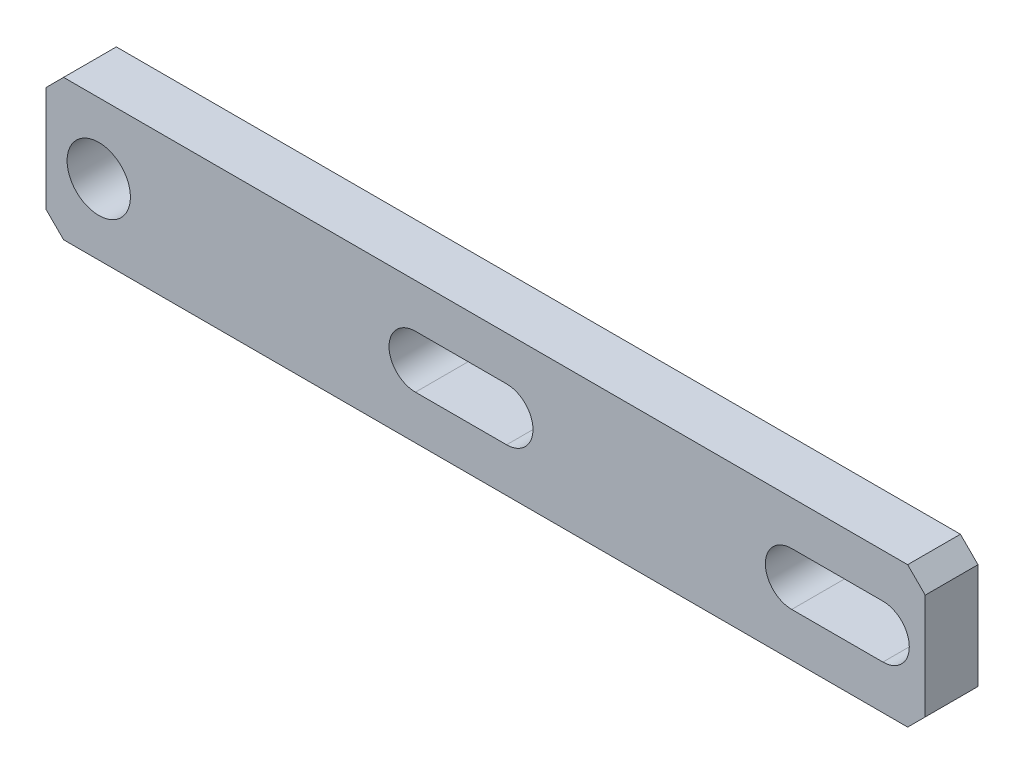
ISO-10303-21;
HEADER;
FILE_DESCRIPTION(('STEP AP214'),'2;1');
FILE_NAME('part.step','',(''),(''),'','','');
FILE_SCHEMA(('AUTOMOTIVE_DESIGN { 1 0 10303 214 1 1 1 1 }'));
ENDSEC;
DATA;
#1=APPLICATION_CONTEXT('core data for automotive mechanical design processes');
#2=APPLICATION_PROTOCOL_DEFINITION('international standard','automotive_design',2000,#1);
#3=PRODUCT_CONTEXT('',#1,'mechanical');
#4=PRODUCT('Part','Part','',(#3));
#5=PRODUCT_RELATED_PRODUCT_CATEGORY('part','',(#4));
#6=PRODUCT_DEFINITION_FORMATION('','',#4);
#7=PRODUCT_DEFINITION_CONTEXT('part definition',#1,'design');
#8=PRODUCT_DEFINITION('design','',#6,#7);
#9=PRODUCT_DEFINITION_SHAPE('','',#8);
#10=(LENGTH_UNIT() NAMED_UNIT(*) SI_UNIT(.MILLI.,.METRE.));
#11=(NAMED_UNIT(*) PLANE_ANGLE_UNIT() SI_UNIT($,.RADIAN.));
#12=(NAMED_UNIT(*) SI_UNIT($,.STERADIAN.) SOLID_ANGLE_UNIT());
#13=UNCERTAINTY_MEASURE_WITH_UNIT(LENGTH_MEASURE(1.E-05),#10,'distance_accuracy_value','');
#14=(GEOMETRIC_REPRESENTATION_CONTEXT(3) GLOBAL_UNCERTAINTY_ASSIGNED_CONTEXT((#13)) GLOBAL_UNIT_ASSIGNED_CONTEXT((#10,
#11,#12)) REPRESENTATION_CONTEXT('',''));
#15=CARTESIAN_POINT('',(0.,0.,0.));
#16=DIRECTION('',(0.,0.,1.));
#17=DIRECTION('',(1.,0.,0.));
#18=AXIS2_PLACEMENT_3D('',#15,#16,#17);
#19=CARTESIAN_POINT('',(265.,20.,15.));
#20=DIRECTION('',(0.,0.,-1.));
#21=DIRECTION('',(-1.,0.,0.));
#22=AXIS2_PLACEMENT_3D('',#19,#20,#21);
#23=PLANE('',#22);
#24=CARTESIAN_POINT('',(15.,20.,15.));
#25=DIRECTION('',(0.,0.,1.));
#26=DIRECTION('',(1.,0.,0.));
#27=AXIS2_PLACEMENT_3D('',#24,#25,#26);
#28=CIRCLE('',#27,9.);
#29=CARTESIAN_POINT('',(24.,20.,15.));
#30=VERTEX_POINT('',#29);
#31=EDGE_CURVE('E380',#30,#30,#28,.T.);
#32=ORIENTED_EDGE('',*,*,#31,.F.);
#33=EDGE_LOOP('',(#32));
#34=FACE_BOUND('',#33,.T.);
#35=DIRECTION('',(-1.,0.,0.));
#36=VECTOR('',#35,1.);
#37=CARTESIAN_POINT('',(130.96,27.5,15.));
#38=LINE('',#37,#36);
#39=CARTESIAN_POINT('',(130.96,27.5,15.));
#40=VERTEX_POINT('',#39);
#41=CARTESIAN_POINT('',(105.04,27.5,15.));
#42=VERTEX_POINT('',#41);
#43=EDGE_CURVE('E176',#40,#42,#38,.T.);
#44=ORIENTED_EDGE('',*,*,#43,.F.);
#45=CARTESIAN_POINT('',(130.96,20.,15.));
#46=DIRECTION('',(0.,0.,1.));
#47=DIRECTION('',(1.,0.,0.));
#48=AXIS2_PLACEMENT_3D('',#45,#46,#47);
#49=CIRCLE('',#48,7.5);
#50=CARTESIAN_POINT('',(130.96,12.5,15.));
#51=VERTEX_POINT('',#50);
#52=EDGE_CURVE('E48',#51,#40,#49,.T.);
#53=ORIENTED_EDGE('',*,*,#52,.F.);
#54=DIRECTION('',(1.,0.,0.));
#55=VECTOR('',#54,1.);
#56=CARTESIAN_POINT('',(130.96,12.5,15.));
#57=LINE('',#56,#55);
#58=CARTESIAN_POINT('',(105.04,12.5,15.));
#59=VERTEX_POINT('',#58);
#60=EDGE_CURVE('E164',#59,#51,#57,.T.);
#61=ORIENTED_EDGE('',*,*,#60,.F.);
#62=CARTESIAN_POINT('',(105.04,20.,15.));
#63=DIRECTION('',(0.,0.,1.));
#64=DIRECTION('',(1.,0.,0.));
#65=AXIS2_PLACEMENT_3D('',#62,#63,#64);
#66=CIRCLE('',#65,7.5);
#67=EDGE_CURVE('E167',#42,#59,#66,.T.);
#68=ORIENTED_EDGE('',*,*,#67,.F.);
#69=EDGE_LOOP('',(#44,#53,#61,#68));
#70=FACE_BOUND('',#69,.T.);
#71=DIRECTION('',(-0.707106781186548,0.707106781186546,0.));
#72=VECTOR('',#71,1.);
#73=CARTESIAN_POINT('',(245.,40.,15.));
#74=LINE('',#73,#72);
#75=CARTESIAN_POINT('',(250.,35.,15.));
#76=VERTEX_POINT('',#75);
#77=CARTESIAN_POINT('',(245.,40.,15.));
#78=VERTEX_POINT('',#77);
#79=EDGE_CURVE('E217',#76,#78,#74,.T.);
#80=ORIENTED_EDGE('',*,*,#79,.T.);
#81=DIRECTION('',(-1.,0.,0.));
#82=VECTOR('',#81,1.);
#83=CARTESIAN_POINT('',(5.,40.,15.));
#84=LINE('',#83,#82);
#85=CARTESIAN_POINT('',(5.,40.,15.));
#86=VERTEX_POINT('',#85);
#87=EDGE_CURVE('E220',#78,#86,#84,.T.);
#88=ORIENTED_EDGE('',*,*,#87,.T.);
#89=DIRECTION('',(-0.707106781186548,-0.707106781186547,0.));
#90=VECTOR('',#89,1.);
#91=CARTESIAN_POINT('',(0.,35.,15.));
#92=LINE('',#91,#90);
#93=CARTESIAN_POINT('',(0.,35.,15.));
#94=VERTEX_POINT('',#93);
#95=EDGE_CURVE('E223',#86,#94,#92,.T.);
#96=ORIENTED_EDGE('',*,*,#95,.T.);
#97=DIRECTION('',(0.,-1.,0.));
#98=VECTOR('',#97,1.);
#99=CARTESIAN_POINT('',(0.,5.,15.));
#100=LINE('',#99,#98);
#101=CARTESIAN_POINT('',(0.,5.,15.));
#102=VERTEX_POINT('',#101);
#103=EDGE_CURVE('E225',#94,#102,#100,.T.);
#104=ORIENTED_EDGE('',*,*,#103,.T.);
#105=DIRECTION('',(0.707106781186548,-0.707106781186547,0.));
#106=VECTOR('',#105,1.);
#107=CARTESIAN_POINT('',(5.,0.,15.));
#108=LINE('',#107,#106);
#109=CARTESIAN_POINT('',(5.,0.,15.));
#110=VERTEX_POINT('',#109);
#111=EDGE_CURVE('E227',#102,#110,#108,.T.);
#112=ORIENTED_EDGE('',*,*,#111,.T.);
#113=DIRECTION('',(1.,0.,0.));
#114=VECTOR('',#113,1.);
#115=CARTESIAN_POINT('',(245.,0.,15.));
#116=LINE('',#115,#114);
#117=CARTESIAN_POINT('',(245.,0.,15.));
#118=VERTEX_POINT('',#117);
#119=EDGE_CURVE('E229',#110,#118,#116,.T.);
#120=ORIENTED_EDGE('',*,*,#119,.T.);
#121=DIRECTION('',(0.707106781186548,0.707106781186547,0.));
#122=VECTOR('',#121,1.);
#123=CARTESIAN_POINT('',(250.,5.,15.));
#124=LINE('',#123,#122);
#125=CARTESIAN_POINT('',(250.,5.,15.));
#126=VERTEX_POINT('',#125);
#127=EDGE_CURVE('E231',#118,#126,#124,.T.);
#128=ORIENTED_EDGE('',*,*,#127,.T.);
#129=DIRECTION('',(0.,1.,0.));
#130=VECTOR('',#129,1.);
#131=CARTESIAN_POINT('',(250.,35.,15.));
#132=LINE('',#131,#130);
#133=EDGE_CURVE('E233',#126,#76,#132,.T.);
#134=ORIENTED_EDGE('',*,*,#133,.T.);
#135=EDGE_LOOP('',(#80,#88,#96,#104,#112,#120,#128,#134));
#136=FACE_BOUND('',#135,.T.);
#137=CARTESIAN_POINT('',(237.960845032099,20.,15.));
#138=DIRECTION('',(0.,0.,1.));
#139=DIRECTION('',(1.,0.,0.));
#140=AXIS2_PLACEMENT_3D('',#137,#138,#139);
#141=CIRCLE('',#140,7.5);
#142=CARTESIAN_POINT('',(237.960845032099,12.5,15.));
#143=VERTEX_POINT('',#142);
#144=CARTESIAN_POINT('',(237.960845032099,27.5,15.));
#145=VERTEX_POINT('',#144);
#146=EDGE_CURVE('E186',#143,#145,#141,.T.);
#147=ORIENTED_EDGE('',*,*,#146,.F.);
#148=DIRECTION('',(1.,0.,0.));
#149=VECTOR('',#148,1.);
#150=CARTESIAN_POINT('',(237.960845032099,12.5,15.));
#151=LINE('',#150,#149);
#152=CARTESIAN_POINT('',(212.039154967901,12.5,15.));
#153=VERTEX_POINT('',#152);
#154=EDGE_CURVE('E194',#153,#143,#151,.T.);
#155=ORIENTED_EDGE('',*,*,#154,.F.);
#156=CARTESIAN_POINT('',(212.039154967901,20.,15.));
#157=DIRECTION('',(0.,0.,1.));
#158=DIRECTION('',(1.,0.,0.));
#159=AXIS2_PLACEMENT_3D('',#156,#157,#158);
#160=CIRCLE('',#159,7.5);
#161=CARTESIAN_POINT('',(212.039154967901,27.5,15.));
#162=VERTEX_POINT('',#161);
#163=EDGE_CURVE('E191',#162,#153,#160,.T.);
#164=ORIENTED_EDGE('',*,*,#163,.F.);
#165=DIRECTION('',(-1.,0.,0.));
#166=VECTOR('',#165,1.);
#167=CARTESIAN_POINT('',(237.960845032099,27.5,15.));
#168=LINE('',#167,#166);
#169=EDGE_CURVE('E188',#145,#162,#168,.T.);
#170=ORIENTED_EDGE('',*,*,#169,.F.);
#171=EDGE_LOOP('',(#147,#155,#164,#170));
#172=FACE_BOUND('',#171,.T.);
#173=ADVANCED_FACE('F33',(#34,#70,#136,#172),#23,.F.);
#174=CARTESIAN_POINT('',(265.,20.,0.));
#175=DIRECTION('',(0.,0.,-1.));
#176=DIRECTION('',(-1.,0.,0.));
#177=AXIS2_PLACEMENT_3D('',#174,#175,#176);
#178=PLANE('',#177);
#179=CARTESIAN_POINT('',(15.,20.,0.));
#180=DIRECTION('',(0.,0.,1.));
#181=DIRECTION('',(1.,0.,0.));
#182=AXIS2_PLACEMENT_3D('',#179,#180,#181);
#183=CIRCLE('',#182,9.);
#184=CARTESIAN_POINT('',(24.,20.,0.));
#185=VERTEX_POINT('',#184);
#186=EDGE_CURVE('E170',#185,#185,#183,.T.);
#187=ORIENTED_EDGE('',*,*,#186,.T.);
#188=EDGE_LOOP('',(#187));
#189=FACE_BOUND('',#188,.T.);
#190=CARTESIAN_POINT('',(130.96,20.,0.));
#191=DIRECTION('',(0.,0.,1.));
#192=DIRECTION('',(1.,0.,0.));
#193=AXIS2_PLACEMENT_3D('',#190,#191,#192);
#194=CIRCLE('',#193,7.5);
#195=CARTESIAN_POINT('',(130.96,12.5,0.));
#196=VERTEX_POINT('',#195);
#197=CARTESIAN_POINT('',(130.96,27.5,0.));
#198=VERTEX_POINT('',#197);
#199=EDGE_CURVE('E148',#196,#198,#194,.T.);
#200=ORIENTED_EDGE('',*,*,#199,.T.);
#201=DIRECTION('',(-1.,0.,0.));
#202=VECTOR('',#201,1.);
#203=CARTESIAN_POINT('',(130.96,27.5,0.));
#204=LINE('',#203,#202);
#205=CARTESIAN_POINT('',(105.04,27.5,0.));
#206=VERTEX_POINT('',#205);
#207=EDGE_CURVE('E157',#198,#206,#204,.T.);
#208=ORIENTED_EDGE('',*,*,#207,.T.);
#209=CARTESIAN_POINT('',(105.04,20.,0.));
#210=DIRECTION('',(0.,0.,1.));
#211=DIRECTION('',(1.,0.,0.));
#212=AXIS2_PLACEMENT_3D('',#209,#210,#211);
#213=CIRCLE('',#212,7.5);
#214=CARTESIAN_POINT('',(105.04,12.5,0.));
#215=VERTEX_POINT('',#214);
#216=EDGE_CURVE('E56',#206,#215,#213,.T.);
#217=ORIENTED_EDGE('',*,*,#216,.T.);
#218=DIRECTION('',(1.,0.,0.));
#219=VECTOR('',#218,1.);
#220=CARTESIAN_POINT('',(130.96,12.5,0.));
#221=LINE('',#220,#219);
#222=EDGE_CURVE('E154',#215,#196,#221,.T.);
#223=ORIENTED_EDGE('',*,*,#222,.T.);
#224=EDGE_LOOP('',(#200,#208,#217,#223));
#225=FACE_BOUND('',#224,.T.);
#226=DIRECTION('',(-0.707106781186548,0.707106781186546,0.));
#227=VECTOR('',#226,1.);
#228=CARTESIAN_POINT('',(245.,40.,0.));
#229=LINE('',#228,#227);
#230=CARTESIAN_POINT('',(250.,35.,0.));
#231=VERTEX_POINT('',#230);
#232=CARTESIAN_POINT('',(245.,40.,0.));
#233=VERTEX_POINT('',#232);
#234=EDGE_CURVE('E216',#231,#233,#229,.T.);
#235=ORIENTED_EDGE('',*,*,#234,.F.);
#236=DIRECTION('',(0.,1.,0.));
#237=VECTOR('',#236,1.);
#238=CARTESIAN_POINT('',(250.,35.,0.));
#239=LINE('',#238,#237);
#240=CARTESIAN_POINT('',(250.,5.,0.));
#241=VERTEX_POINT('',#240);
#242=EDGE_CURVE('E221',#241,#231,#239,.T.);
#243=ORIENTED_EDGE('',*,*,#242,.F.);
#244=DIRECTION('',(0.707106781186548,0.707106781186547,0.));
#245=VECTOR('',#244,1.);
#246=CARTESIAN_POINT('',(250.,5.,0.));
#247=LINE('',#246,#245);
#248=CARTESIAN_POINT('',(245.,0.,0.));
#249=VERTEX_POINT('',#248);
#250=EDGE_CURVE('E248',#249,#241,#247,.T.);
#251=ORIENTED_EDGE('',*,*,#250,.F.);
#252=DIRECTION('',(1.,0.,0.));
#253=VECTOR('',#252,1.);
#254=CARTESIAN_POINT('',(245.,0.,0.));
#255=LINE('',#254,#253);
#256=CARTESIAN_POINT('',(5.,0.,0.));
#257=VERTEX_POINT('',#256);
#258=EDGE_CURVE('E246',#257,#249,#255,.T.);
#259=ORIENTED_EDGE('',*,*,#258,.F.);
#260=DIRECTION('',(0.707106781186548,-0.707106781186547,0.));
#261=VECTOR('',#260,1.);
#262=CARTESIAN_POINT('',(5.,0.,0.));
#263=LINE('',#262,#261);
#264=CARTESIAN_POINT('',(0.,5.,0.));
#265=VERTEX_POINT('',#264);
#266=EDGE_CURVE('E244',#265,#257,#263,.T.);
#267=ORIENTED_EDGE('',*,*,#266,.F.);
#268=DIRECTION('',(0.,-1.,0.));
#269=VECTOR('',#268,1.);
#270=CARTESIAN_POINT('',(0.,5.,0.));
#271=LINE('',#270,#269);
#272=CARTESIAN_POINT('',(0.,35.,0.));
#273=VERTEX_POINT('',#272);
#274=EDGE_CURVE('E242',#273,#265,#271,.T.);
#275=ORIENTED_EDGE('',*,*,#274,.F.);
#276=DIRECTION('',(-0.707106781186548,-0.707106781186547,0.));
#277=VECTOR('',#276,1.);
#278=CARTESIAN_POINT('',(0.,35.,0.));
#279=LINE('',#278,#277);
#280=CARTESIAN_POINT('',(5.,40.,0.));
#281=VERTEX_POINT('',#280);
#282=EDGE_CURVE('E240',#281,#273,#279,.T.);
#283=ORIENTED_EDGE('',*,*,#282,.F.);
#284=DIRECTION('',(-1.,0.,0.));
#285=VECTOR('',#284,1.);
#286=CARTESIAN_POINT('',(5.,40.,0.));
#287=LINE('',#286,#285);
#288=EDGE_CURVE('E238',#233,#281,#287,.T.);
#289=ORIENTED_EDGE('',*,*,#288,.F.);
#290=EDGE_LOOP('',(#235,#243,#251,#259,#267,#275,#283,#289));
#291=FACE_BOUND('',#290,.T.);
#292=DIRECTION('',(1.,0.,0.));
#293=VECTOR('',#292,1.);
#294=CARTESIAN_POINT('',(237.960845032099,12.5,0.));
#295=LINE('',#294,#293);
#296=CARTESIAN_POINT('',(212.039154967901,12.5,0.));
#297=VERTEX_POINT('',#296);
#298=CARTESIAN_POINT('',(237.960845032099,12.5,0.));
#299=VERTEX_POINT('',#298);
#300=EDGE_CURVE('E189',#297,#299,#295,.T.);
#301=ORIENTED_EDGE('',*,*,#300,.T.);
#302=CARTESIAN_POINT('',(237.960845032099,20.,0.));
#303=DIRECTION('',(0.,0.,1.));
#304=DIRECTION('',(1.,0.,0.));
#305=AXIS2_PLACEMENT_3D('',#302,#303,#304);
#306=CIRCLE('',#305,7.5);
#307=CARTESIAN_POINT('',(237.960845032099,27.5,0.));
#308=VERTEX_POINT('',#307);
#309=EDGE_CURVE('E182',#299,#308,#306,.T.);
#310=ORIENTED_EDGE('',*,*,#309,.T.);
#311=DIRECTION('',(-1.,0.,0.));
#312=VECTOR('',#311,1.);
#313=CARTESIAN_POINT('',(237.960845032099,27.5,0.));
#314=LINE('',#313,#312);
#315=CARTESIAN_POINT('',(212.039154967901,27.5,0.));
#316=VERTEX_POINT('',#315);
#317=EDGE_CURVE('E199',#308,#316,#314,.T.);
#318=ORIENTED_EDGE('',*,*,#317,.T.);
#319=CARTESIAN_POINT('',(212.039154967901,20.,0.));
#320=DIRECTION('',(0.,0.,1.));
#321=DIRECTION('',(1.,0.,0.));
#322=AXIS2_PLACEMENT_3D('',#319,#320,#321);
#323=CIRCLE('',#322,7.5);
#324=EDGE_CURVE('E202',#316,#297,#323,.T.);
#325=ORIENTED_EDGE('',*,*,#324,.T.);
#326=EDGE_LOOP('',(#301,#310,#318,#325));
#327=FACE_BOUND('',#326,.T.);
#328=ADVANCED_FACE('F161',(#189,#225,#291,#327),#178,.T.);
#329=CARTESIAN_POINT('',(245.,40.,15.));
#330=DIRECTION('',(-0.707106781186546,-0.707106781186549,0.));
#331=DIRECTION('',(0.707106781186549,-0.707106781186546,0.));
#332=AXIS2_PLACEMENT_3D('',#329,#330,#331);
#333=PLANE('',#332);
#334=ORIENTED_EDGE('',*,*,#234,.T.);
#335=DIRECTION('',(0.,0.,-1.));
#336=VECTOR('',#335,1.);
#337=CARTESIAN_POINT('',(245.,40.,15.));
#338=LINE('',#337,#336);
#339=EDGE_CURVE('E11',#78,#233,#338,.T.);
#340=ORIENTED_EDGE('',*,*,#339,.F.);
#341=ORIENTED_EDGE('',*,*,#79,.F.);
#342=DIRECTION('',(0.,0.,-1.));
#343=VECTOR('',#342,1.);
#344=CARTESIAN_POINT('',(250.,35.,15.));
#345=LINE('',#344,#343);
#346=EDGE_CURVE('E235',#76,#231,#345,.T.);
#347=ORIENTED_EDGE('',*,*,#346,.T.);
#348=EDGE_LOOP('',(#334,#340,#341,#347));
#349=FACE_BOUND('',#348,.T.);
#350=ADVANCED_FACE('F35',(#349),#333,.F.);
#351=CARTESIAN_POINT('',(5.,40.,15.));
#352=DIRECTION('',(0.,-1.,0.));
#353=DIRECTION('',(1.,0.,0.));
#354=AXIS2_PLACEMENT_3D('',#351,#352,#353);
#355=PLANE('',#354);
#356=ORIENTED_EDGE('',*,*,#288,.T.);
#357=DIRECTION('',(0.,0.,-1.));
#358=VECTOR('',#357,1.);
#359=CARTESIAN_POINT('',(5.,40.,15.));
#360=LINE('',#359,#358);
#361=EDGE_CURVE('E41',#86,#281,#360,.T.);
#362=ORIENTED_EDGE('',*,*,#361,.F.);
#363=ORIENTED_EDGE('',*,*,#87,.F.);
#364=ORIENTED_EDGE('',*,*,#339,.T.);
#365=EDGE_LOOP('',(#356,#362,#363,#364));
#366=FACE_BOUND('',#365,.T.);
#367=ADVANCED_FACE('F294',(#366),#355,.F.);
#368=CARTESIAN_POINT('',(0.,35.,15.));
#369=DIRECTION('',(0.707106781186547,-0.707106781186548,0.));
#370=DIRECTION('',(0.707106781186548,0.707106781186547,0.));
#371=AXIS2_PLACEMENT_3D('',#368,#369,#370);
#372=PLANE('',#371);
#373=ORIENTED_EDGE('',*,*,#282,.T.);
#374=DIRECTION('',(0.,0.,-1.));
#375=VECTOR('',#374,1.);
#376=CARTESIAN_POINT('',(0.,35.,15.));
#377=LINE('',#376,#375);
#378=EDGE_CURVE('E265',#94,#273,#377,.T.);
#379=ORIENTED_EDGE('',*,*,#378,.F.);
#380=ORIENTED_EDGE('',*,*,#95,.F.);
#381=ORIENTED_EDGE('',*,*,#361,.T.);
#382=EDGE_LOOP('',(#373,#379,#380,#381));
#383=FACE_BOUND('',#382,.T.);
#384=ADVANCED_FACE('F272',(#383),#372,.F.);
#385=CARTESIAN_POINT('',(0.,5.,15.));
#386=DIRECTION('',(1.,0.,0.));
#387=DIRECTION('',(0.,0.,-1.));
#388=AXIS2_PLACEMENT_3D('',#385,#386,#387);
#389=PLANE('',#388);
#390=ORIENTED_EDGE('',*,*,#274,.T.);
#391=DIRECTION('',(0.,0.,-1.));
#392=VECTOR('',#391,1.);
#393=CARTESIAN_POINT('',(0.,5.,15.));
#394=LINE('',#393,#392);
#395=EDGE_CURVE('E262',#102,#265,#394,.T.);
#396=ORIENTED_EDGE('',*,*,#395,.F.);
#397=ORIENTED_EDGE('',*,*,#103,.F.);
#398=ORIENTED_EDGE('',*,*,#378,.T.);
#399=EDGE_LOOP('',(#390,#396,#397,#398));
#400=FACE_BOUND('',#399,.T.);
#401=ADVANCED_FACE('F282',(#400),#389,.F.);
#402=CARTESIAN_POINT('',(5.,0.,15.));
#403=DIRECTION('',(0.707106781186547,0.707106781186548,0.));
#404=DIRECTION('',(-0.707106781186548,0.707106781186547,0.));
#405=AXIS2_PLACEMENT_3D('',#402,#403,#404);
#406=PLANE('',#405);
#407=ORIENTED_EDGE('',*,*,#266,.T.);
#408=DIRECTION('',(0.,0.,-1.));
#409=VECTOR('',#408,1.);
#410=CARTESIAN_POINT('',(5.,0.,15.));
#411=LINE('',#410,#409);
#412=EDGE_CURVE('E259',#110,#257,#411,.T.);
#413=ORIENTED_EDGE('',*,*,#412,.F.);
#414=ORIENTED_EDGE('',*,*,#111,.F.);
#415=ORIENTED_EDGE('',*,*,#395,.T.);
#416=EDGE_LOOP('',(#407,#413,#414,#415));
#417=FACE_BOUND('',#416,.T.);
#418=ADVANCED_FACE('F286',(#417),#406,.F.);
#419=CARTESIAN_POINT('',(245.,0.,15.));
#420=DIRECTION('',(0.,1.,0.));
#421=DIRECTION('',(-1.,0.,0.));
#422=AXIS2_PLACEMENT_3D('',#419,#420,#421);
#423=PLANE('',#422);
#424=ORIENTED_EDGE('',*,*,#258,.T.);
#425=DIRECTION('',(0.,0.,-1.));
#426=VECTOR('',#425,1.);
#427=CARTESIAN_POINT('',(245.,0.,15.));
#428=LINE('',#427,#426);
#429=EDGE_CURVE('E256',#118,#249,#428,.T.);
#430=ORIENTED_EDGE('',*,*,#429,.F.);
#431=ORIENTED_EDGE('',*,*,#119,.F.);
#432=ORIENTED_EDGE('',*,*,#412,.T.);
#433=EDGE_LOOP('',(#424,#430,#431,#432));
#434=FACE_BOUND('',#433,.T.);
#435=ADVANCED_FACE('F307',(#434),#423,.F.);
#436=CARTESIAN_POINT('',(250.,5.,15.));
#437=DIRECTION('',(-0.707106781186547,0.707106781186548,0.));
#438=DIRECTION('',(-0.707106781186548,-0.707106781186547,0.));
#439=AXIS2_PLACEMENT_3D('',#436,#437,#438);
#440=PLANE('',#439);
#441=ORIENTED_EDGE('',*,*,#250,.T.);
#442=DIRECTION('',(0.,0.,-1.));
#443=VECTOR('',#442,1.);
#444=CARTESIAN_POINT('',(250.,5.,15.));
#445=LINE('',#444,#443);
#446=EDGE_CURVE('E253',#126,#241,#445,.T.);
#447=ORIENTED_EDGE('',*,*,#446,.F.);
#448=ORIENTED_EDGE('',*,*,#127,.F.);
#449=ORIENTED_EDGE('',*,*,#429,.T.);
#450=EDGE_LOOP('',(#441,#447,#448,#449));
#451=FACE_BOUND('',#450,.T.);
#452=ADVANCED_FACE('F305',(#451),#440,.F.);
#453=CARTESIAN_POINT('',(250.,35.,15.));
#454=DIRECTION('',(-1.,0.,0.));
#455=DIRECTION('',(0.,0.,1.));
#456=AXIS2_PLACEMENT_3D('',#453,#454,#455);
#457=PLANE('',#456);
#458=ORIENTED_EDGE('',*,*,#242,.T.);
#459=ORIENTED_EDGE('',*,*,#346,.F.);
#460=ORIENTED_EDGE('',*,*,#133,.F.);
#461=ORIENTED_EDGE('',*,*,#446,.T.);
#462=EDGE_LOOP('',(#458,#459,#460,#461));
#463=FACE_BOUND('',#462,.T.);
#464=ADVANCED_FACE('F300',(#463),#457,.F.);
#465=CARTESIAN_POINT('',(237.960845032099,20.,15.));
#466=DIRECTION('',(0.,0.,-1.));
#467=DIRECTION('',(-1.,0.,0.));
#468=AXIS2_PLACEMENT_3D('',#465,#466,#467);
#469=CYLINDRICAL_SURFACE('',#468,7.5);
#470=ORIENTED_EDGE('',*,*,#309,.F.);
#471=DIRECTION('',(0.,0.,-1.));
#472=VECTOR('',#471,1.);
#473=CARTESIAN_POINT('',(237.960845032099,12.5,15.));
#474=LINE('',#473,#472);
#475=EDGE_CURVE('E196',#143,#299,#474,.T.);
#476=ORIENTED_EDGE('',*,*,#475,.F.);
#477=ORIENTED_EDGE('',*,*,#146,.T.);
#478=DIRECTION('',(0.,0.,-1.));
#479=VECTOR('',#478,1.);
#480=CARTESIAN_POINT('',(237.960845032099,27.5,15.));
#481=LINE('',#480,#479);
#482=EDGE_CURVE('E213',#145,#308,#481,.T.);
#483=ORIENTED_EDGE('',*,*,#482,.T.);
#484=EDGE_LOOP('',(#470,#476,#477,#483));
#485=FACE_BOUND('',#484,.T.);
#486=ADVANCED_FACE('F327',(#485),#469,.F.);
#487=CARTESIAN_POINT('',(237.960845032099,27.5,15.));
#488=DIRECTION('',(0.,-1.,0.));
#489=DIRECTION('',(1.,0.,0.));
#490=AXIS2_PLACEMENT_3D('',#487,#488,#489);
#491=PLANE('',#490);
#492=ORIENTED_EDGE('',*,*,#317,.F.);
#493=ORIENTED_EDGE('',*,*,#482,.F.);
#494=ORIENTED_EDGE('',*,*,#169,.T.);
#495=DIRECTION('',(0.,0.,-1.));
#496=VECTOR('',#495,1.);
#497=CARTESIAN_POINT('',(212.039154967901,27.5,15.));
#498=LINE('',#497,#496);
#499=EDGE_CURVE('E211',#162,#316,#498,.T.);
#500=ORIENTED_EDGE('',*,*,#499,.T.);
#501=EDGE_LOOP('',(#492,#493,#494,#500));
#502=FACE_BOUND('',#501,.T.);
#503=ADVANCED_FACE('F334',(#502),#491,.T.);
#504=CARTESIAN_POINT('',(212.039154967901,20.,15.));
#505=DIRECTION('',(0.,0.,-1.));
#506=DIRECTION('',(-1.,0.,0.));
#507=AXIS2_PLACEMENT_3D('',#504,#505,#506);
#508=CYLINDRICAL_SURFACE('',#507,7.5);
#509=ORIENTED_EDGE('',*,*,#324,.F.);
#510=ORIENTED_EDGE('',*,*,#499,.F.);
#511=ORIENTED_EDGE('',*,*,#163,.T.);
#512=DIRECTION('',(0.,0.,-1.));
#513=VECTOR('',#512,1.);
#514=CARTESIAN_POINT('',(212.039154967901,12.5,15.));
#515=LINE('',#514,#513);
#516=EDGE_CURVE('E209',#153,#297,#515,.T.);
#517=ORIENTED_EDGE('',*,*,#516,.T.);
#518=EDGE_LOOP('',(#509,#510,#511,#517));
#519=FACE_BOUND('',#518,.T.);
#520=ADVANCED_FACE('F339',(#519),#508,.F.);
#521=CARTESIAN_POINT('',(237.960845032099,12.5,15.));
#522=DIRECTION('',(0.,1.,0.));
#523=DIRECTION('',(-1.,0.,0.));
#524=AXIS2_PLACEMENT_3D('',#521,#522,#523);
#525=PLANE('',#524);
#526=ORIENTED_EDGE('',*,*,#300,.F.);
#527=ORIENTED_EDGE('',*,*,#516,.F.);
#528=ORIENTED_EDGE('',*,*,#154,.T.);
#529=ORIENTED_EDGE('',*,*,#475,.T.);
#530=EDGE_LOOP('',(#526,#527,#528,#529));
#531=FACE_BOUND('',#530,.T.);
#532=ADVANCED_FACE('F346',(#531),#525,.T.);
#533=CARTESIAN_POINT('',(130.96,20.,0.));
#534=DIRECTION('',(0.,0.,1.));
#535=DIRECTION('',(1.,0.,0.));
#536=AXIS2_PLACEMENT_3D('',#533,#534,#535);
#537=CYLINDRICAL_SURFACE('',#536,7.5);
#538=ORIENTED_EDGE('',*,*,#52,.T.);
#539=DIRECTION('',(0.,0.,1.));
#540=VECTOR('',#539,1.);
#541=CARTESIAN_POINT('',(130.96,27.5,0.));
#542=LINE('',#541,#540);
#543=EDGE_CURVE('E144',#198,#40,#542,.T.);
#544=ORIENTED_EDGE('',*,*,#543,.F.);
#545=ORIENTED_EDGE('',*,*,#199,.F.);
#546=DIRECTION('',(0.,0.,1.));
#547=VECTOR('',#546,1.);
#548=CARTESIAN_POINT('',(130.96,12.5,0.));
#549=LINE('',#548,#547);
#550=EDGE_CURVE('E180',#196,#51,#549,.T.);
#551=ORIENTED_EDGE('',*,*,#550,.T.);
#552=EDGE_LOOP('',(#538,#544,#545,#551));
#553=FACE_BOUND('',#552,.T.);
#554=ADVANCED_FACE('F146',(#553),#537,.F.);
#555=CARTESIAN_POINT('',(130.96,12.5,0.));
#556=DIRECTION('',(0.,-1.,0.));
#557=DIRECTION('',(1.,0.,0.));
#558=AXIS2_PLACEMENT_3D('',#555,#556,#557);
#559=PLANE('',#558);
#560=ORIENTED_EDGE('',*,*,#60,.T.);
#561=ORIENTED_EDGE('',*,*,#550,.F.);
#562=ORIENTED_EDGE('',*,*,#222,.F.);
#563=DIRECTION('',(0.,0.,1.));
#564=VECTOR('',#563,1.);
#565=CARTESIAN_POINT('',(105.04,12.5,0.));
#566=LINE('',#565,#564);
#567=EDGE_CURVE('E183',#215,#59,#566,.T.);
#568=ORIENTED_EDGE('',*,*,#567,.T.);
#569=EDGE_LOOP('',(#560,#561,#562,#568));
#570=FACE_BOUND('',#569,.T.);
#571=ADVANCED_FACE('F362',(#570),#559,.F.);
#572=CARTESIAN_POINT('',(105.04,20.,0.));
#573=DIRECTION('',(0.,0.,1.));
#574=DIRECTION('',(1.,0.,0.));
#575=AXIS2_PLACEMENT_3D('',#572,#573,#574);
#576=CYLINDRICAL_SURFACE('',#575,7.5);
#577=ORIENTED_EDGE('',*,*,#67,.T.);
#578=ORIENTED_EDGE('',*,*,#567,.F.);
#579=ORIENTED_EDGE('',*,*,#216,.F.);
#580=DIRECTION('',(0.,0.,1.));
#581=VECTOR('',#580,1.);
#582=CARTESIAN_POINT('',(105.04,27.5,0.));
#583=LINE('',#582,#581);
#584=EDGE_CURVE('E153',#206,#42,#583,.T.);
#585=ORIENTED_EDGE('',*,*,#584,.T.);
#586=EDGE_LOOP('',(#577,#578,#579,#585));
#587=FACE_BOUND('',#586,.T.);
#588=ADVANCED_FACE('F366',(#587),#576,.F.);
#589=CARTESIAN_POINT('',(130.96,27.5,0.));
#590=DIRECTION('',(0.,1.,0.));
#591=DIRECTION('',(-1.,0.,0.));
#592=AXIS2_PLACEMENT_3D('',#589,#590,#591);
#593=PLANE('',#592);
#594=ORIENTED_EDGE('',*,*,#43,.T.);
#595=ORIENTED_EDGE('',*,*,#584,.F.);
#596=ORIENTED_EDGE('',*,*,#207,.F.);
#597=ORIENTED_EDGE('',*,*,#543,.T.);
#598=EDGE_LOOP('',(#594,#595,#596,#597));
#599=FACE_BOUND('',#598,.T.);
#600=ADVANCED_FACE('F158',(#599),#593,.F.);
#601=CARTESIAN_POINT('',(15.,20.,15.));
#602=DIRECTION('',(0.,0.,1.));
#603=DIRECTION('',(1.,0.,0.));
#604=AXIS2_PLACEMENT_3D('',#601,#602,#603);
#605=CYLINDRICAL_SURFACE('',#604,9.);
#606=ORIENTED_EDGE('',*,*,#186,.F.);
#607=EDGE_LOOP('',(#606));
#608=FACE_BOUND('',#607,.T.);
#609=ORIENTED_EDGE('',*,*,#31,.T.);
#610=EDGE_LOOP('',(#609));
#611=FACE_BOUND('',#610,.T.);
#612=ADVANCED_FACE('F365',(#608,#611),#605,.F.);
#613=CLOSED_SHELL('',(#173,#328,#350,#367,#384,#401,#418,#435,#452,#464,#486,#503,#520,#532,
#554,#571,#588,#600,#612));
#614=MANIFOLD_SOLID_BREP('B2',#613);
#615=ADVANCED_BREP_SHAPE_REPRESENTATION('',(#18,#614),#14);
#616=SHAPE_DEFINITION_REPRESENTATION(#9,#615);
ENDSEC;
END-ISO-10303-21;
